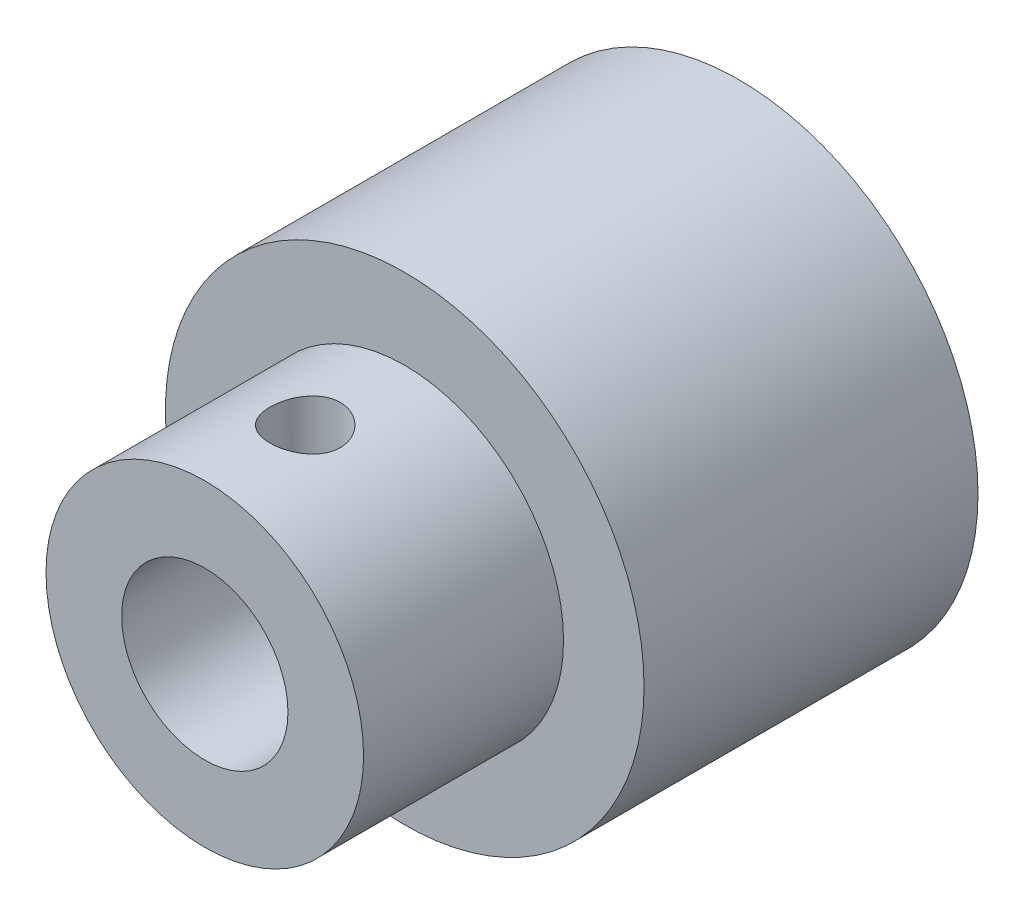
ISO-10303-21;
HEADER;
FILE_DESCRIPTION(('STEP AP214'),'2;1');
FILE_NAME('part.step','',(''),(''),'','','');
FILE_SCHEMA(('AUTOMOTIVE_DESIGN { 1 0 10303 214 1 1 1 1 }'));
ENDSEC;
DATA;
#1=APPLICATION_CONTEXT('core data for automotive mechanical design processes');
#2=APPLICATION_PROTOCOL_DEFINITION('international standard','automotive_design',2000,#1);
#3=PRODUCT_CONTEXT('',#1,'mechanical');
#4=PRODUCT('Part','Part','',(#3));
#5=PRODUCT_RELATED_PRODUCT_CATEGORY('part','',(#4));
#6=PRODUCT_DEFINITION_FORMATION('','',#4);
#7=PRODUCT_DEFINITION_CONTEXT('part definition',#1,'design');
#8=PRODUCT_DEFINITION('design','',#6,#7);
#9=PRODUCT_DEFINITION_SHAPE('','',#8);
#10=(LENGTH_UNIT() NAMED_UNIT(*) SI_UNIT(.MILLI.,.METRE.));
#11=(NAMED_UNIT(*) PLANE_ANGLE_UNIT() SI_UNIT($,.RADIAN.));
#12=(NAMED_UNIT(*) SI_UNIT($,.STERADIAN.) SOLID_ANGLE_UNIT());
#13=UNCERTAINTY_MEASURE_WITH_UNIT(LENGTH_MEASURE(1.E-05),#10,'distance_accuracy_value','');
#14=(GEOMETRIC_REPRESENTATION_CONTEXT(3) GLOBAL_UNCERTAINTY_ASSIGNED_CONTEXT((#13)) GLOBAL_UNIT_ASSIGNED_CONTEXT((#10,
#11,#12)) REPRESENTATION_CONTEXT('',''));
#15=CARTESIAN_POINT('',(0.,0.,0.));
#16=DIRECTION('',(0.,0.,1.));
#17=DIRECTION('',(1.,0.,0.));
#18=AXIS2_PLACEMENT_3D('',#15,#16,#17);
#19=CARTESIAN_POINT('',(0.,0.,0.));
#20=DIRECTION('',(0.,0.,1.));
#21=DIRECTION('',(1.,0.,0.));
#22=AXIS2_PLACEMENT_3D('',#19,#20,#21);
#23=PLANE('',#22);
#24=CARTESIAN_POINT('',(0.,0.,0.));
#25=DIRECTION('',(0.,0.,1.));
#26=DIRECTION('',(1.,0.,0.));
#27=AXIS2_PLACEMENT_3D('',#24,#25,#26);
#28=CIRCLE('',#27,14.2875);
#29=CARTESIAN_POINT('',(14.2875,0.,0.));
#30=VERTEX_POINT('',#29);
#31=EDGE_CURVE('E42',#30,#30,#28,.T.);
#32=ORIENTED_EDGE('',*,*,#31,.T.);
#33=EDGE_LOOP('',(#32));
#34=FACE_BOUND('',#33,.T.);
#35=CARTESIAN_POINT('',(0.,0.,0.));
#36=DIRECTION('',(0.,0.,1.));
#37=DIRECTION('',(1.,0.,0.));
#38=AXIS2_PLACEMENT_3D('',#35,#36,#37);
#39=CIRCLE('',#38,9.48055);
#40=CARTESIAN_POINT('',(9.48055,0.,0.));
#41=VERTEX_POINT('',#40);
#42=EDGE_CURVE('E51',#41,#41,#39,.T.);
#43=ORIENTED_EDGE('',*,*,#42,.F.);
#44=EDGE_LOOP('',(#43));
#45=FACE_BOUND('',#44,.T.);
#46=ADVANCED_FACE('F38',(#34,#45),#23,.T.);
#47=CARTESIAN_POINT('',(0.,0.,-19.939));
#48=DIRECTION('',(0.,0.,1.));
#49=DIRECTION('',(1.,0.,0.));
#50=AXIS2_PLACEMENT_3D('',#47,#48,#49);
#51=CYLINDRICAL_SURFACE('',#50,14.2875);
#52=CARTESIAN_POINT('',(0.,0.,-19.939));
#53=DIRECTION('',(0.,0.,1.));
#54=DIRECTION('',(1.,0.,0.));
#55=AXIS2_PLACEMENT_3D('',#52,#53,#54);
#56=CIRCLE('',#55,14.2875);
#57=CARTESIAN_POINT('',(14.2875,0.,-19.939));
#58=VERTEX_POINT('',#57);
#59=EDGE_CURVE('E10',#58,#58,#56,.T.);
#60=ORIENTED_EDGE('',*,*,#59,.T.);
#61=EDGE_LOOP('',(#60));
#62=FACE_BOUND('',#61,.T.);
#63=ORIENTED_EDGE('',*,*,#31,.F.);
#64=EDGE_LOOP('',(#63));
#65=FACE_BOUND('',#64,.T.);
#66=ADVANCED_FACE('F40',(#62,#65),#51,.T.);
#67=CARTESIAN_POINT('',(0.,0.,-19.939));
#68=DIRECTION('',(0.,0.,1.));
#69=DIRECTION('',(1.,0.,0.));
#70=AXIS2_PLACEMENT_3D('',#67,#68,#69);
#71=PLANE('',#70);
#72=CARTESIAN_POINT('',(0.,0.,-19.939));
#73=DIRECTION('',(0.,0.,1.));
#74=DIRECTION('',(1.,0.,0.));
#75=AXIS2_PLACEMENT_3D('',#72,#73,#74);
#76=CIRCLE('',#75,4.96569999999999);
#77=CARTESIAN_POINT('',(4.96569999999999,0.,-19.939));
#78=VERTEX_POINT('',#77);
#79=EDGE_CURVE('E54',#78,#78,#76,.T.);
#80=ORIENTED_EDGE('',*,*,#79,.T.);
#81=EDGE_LOOP('',(#80));
#82=FACE_BOUND('',#81,.T.);
#83=ORIENTED_EDGE('',*,*,#59,.F.);
#84=EDGE_LOOP('',(#83));
#85=FACE_BOUND('',#84,.T.);
#86=ADVANCED_FACE('F95',(#82,#85),#71,.F.);
#87=CARTESIAN_POINT('',(0.,0.,11.938));
#88=DIRECTION('',(0.,0.,-1.));
#89=DIRECTION('',(-1.,0.,0.));
#90=AXIS2_PLACEMENT_3D('',#87,#88,#89);
#91=CYLINDRICAL_SURFACE('',#90,9.48055);
#92=CARTESIAN_POINT('',(0.,9.48055,8.04360000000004));
#93=CARTESIAN_POINT('',(-0.116434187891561,9.48054785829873,8.04359607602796));
#94=CARTESIAN_POINT('',(-0.232915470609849,9.47838328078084,8.03388380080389));
#95=CARTESIAN_POINT('',(-0.462566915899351,9.46995747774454,7.99533313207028));
#96=CARTESIAN_POINT('',(-0.575734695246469,9.46369337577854,7.96648130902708));
#97=CARTESIAN_POINT('',(-0.795407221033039,9.44776566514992,7.89060154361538));
#98=CARTESIAN_POINT('',(-0.901918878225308,9.43810565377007,7.84359282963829));
#99=CARTESIAN_POINT('',(-1.10553997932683,9.41642754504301,7.73279528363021));
#100=CARTESIAN_POINT('',(-1.20264961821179,9.40440949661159,7.66900679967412));
#101=CARTESIAN_POINT('',(-1.38630919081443,9.37911007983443,7.52535137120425));
#102=CARTESIAN_POINT('',(-1.47268252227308,9.36581271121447,7.44526144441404));
#103=CARTESIAN_POINT('',(-1.63088604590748,9.33956553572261,7.27175518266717));
#104=CARTESIAN_POINT('',(-1.70271491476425,9.32661576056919,7.17833763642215));
#105=CARTESIAN_POINT('',(-1.83057402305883,9.30237195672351,6.97951667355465));
#106=CARTESIAN_POINT('',(-1.88641545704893,9.29109841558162,6.87398911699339));
#107=CARTESIAN_POINT('',(-1.97950321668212,9.27171349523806,6.65475674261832));
#108=CARTESIAN_POINT('',(-2.01675182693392,9.2636017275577,6.54105293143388));
#109=CARTESIAN_POINT('',(-2.07101134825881,9.25162188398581,6.31061368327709));
#110=CARTESIAN_POINT('',(-2.08833535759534,9.24768823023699,6.1939554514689));
#111=CARTESIAN_POINT('',(-2.10322760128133,9.24431310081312,5.95932717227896));
#112=CARTESIAN_POINT('',(-2.1007983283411,9.24487105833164,5.84135729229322));
#113=CARTESIAN_POINT('',(-2.07650474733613,9.2503567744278,5.60978799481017));
#114=CARTESIAN_POINT('',(-2.05500492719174,9.25520257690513,5.49614810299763));
#115=CARTESIAN_POINT('',(-1.9937583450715,9.26858832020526,5.27412935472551));
#116=CARTESIAN_POINT('',(-1.95401053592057,9.27712847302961,5.16575080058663));
#117=CARTESIAN_POINT('',(-1.85706363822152,9.29702095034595,4.95631052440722));
#118=CARTESIAN_POINT('',(-1.79972506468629,9.30839561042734,4.8553155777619));
#119=CARTESIAN_POINT('',(-1.66932230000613,9.33266185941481,4.66424627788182));
#120=CARTESIAN_POINT('',(-1.59625591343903,9.34555365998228,4.57417345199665));
#121=CARTESIAN_POINT('',(-1.43454566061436,9.37175270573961,4.40540753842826));
#122=CARTESIAN_POINT('',(-1.34559204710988,9.38506282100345,4.32701139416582));
#123=CARTESIAN_POINT('',(-1.15564865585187,9.4103384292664,4.18620061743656));
#124=CARTESIAN_POINT('',(-1.0546586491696,9.42230389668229,4.12378628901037));
#125=CARTESIAN_POINT('',(-0.843141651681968,9.44358243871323,4.01663455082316));
#126=CARTESIAN_POINT('',(-0.732593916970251,9.45288954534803,3.97193682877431));
#127=CARTESIAN_POINT('',(-0.505304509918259,9.46775845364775,3.9018347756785));
#128=CARTESIAN_POINT('',(-0.388563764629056,9.47332081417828,3.87642756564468));
#129=CARTESIAN_POINT('',(-0.154748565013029,9.47999368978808,3.84606145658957));
#130=CARTESIAN_POINT('',(-0.0377292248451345,9.48119247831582,3.84069703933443));
#131=CARTESIAN_POINT('',(0.195533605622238,9.4792508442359,3.84946855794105));
#132=CARTESIAN_POINT('',(0.311777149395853,9.47611072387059,3.86360313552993));
#133=CARTESIAN_POINT('',(0.538839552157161,9.46589988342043,3.91063529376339));
#134=CARTESIAN_POINT('',(0.64970480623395,9.4588738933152,3.94331946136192));
#135=CARTESIAN_POINT('',(0.864378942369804,9.44167804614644,4.02628556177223));
#136=CARTESIAN_POINT('',(0.96818721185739,9.43150791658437,4.0765690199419));
#137=CARTESIAN_POINT('',(1.16747219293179,9.40893460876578,4.19414626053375));
#138=CARTESIAN_POINT('',(1.26280537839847,9.39650103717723,4.26167734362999));
#139=CARTESIAN_POINT('',(1.44093176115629,9.37084077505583,4.41152118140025));
#140=CARTESIAN_POINT('',(1.52372328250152,9.35761397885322,4.49383590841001));
#141=CARTESIAN_POINT('',(1.67602525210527,9.331552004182,4.67277333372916));
#142=CARTESIAN_POINT('',(1.74525455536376,9.31872898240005,4.76963743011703));
#143=CARTESIAN_POINT('',(1.8664650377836,9.29521188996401,4.97385513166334));
#144=CARTESIAN_POINT('',(1.91844696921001,9.28451772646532,5.08120827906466));
#145=CARTESIAN_POINT('',(2.0033317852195,9.26657292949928,5.30277786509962));
#146=CARTESIAN_POINT('',(2.03634290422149,9.25930280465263,5.41695118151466));
#147=CARTESIAN_POINT('',(2.08266401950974,9.24899520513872,5.64940659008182));
#148=CARTESIAN_POINT('',(2.09597725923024,9.24595703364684,5.76768800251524));
#149=CARTESIAN_POINT('',(2.10238393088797,9.24450203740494,6.00216529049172));
#150=CARTESIAN_POINT('',(2.0959233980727,9.24598326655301,6.11834856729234));
#151=CARTESIAN_POINT('',(2.06396504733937,9.25316918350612,6.34792666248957));
#152=CARTESIAN_POINT('',(2.03846746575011,9.25887381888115,6.46132151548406));
#153=CARTESIAN_POINT('',(1.96937677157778,9.27381346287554,6.68173863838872));
#154=CARTESIAN_POINT('',(1.9258501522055,9.28303548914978,6.78878268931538));
#155=CARTESIAN_POINT('',(1.82199348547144,9.30397560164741,6.99411456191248));
#156=CARTESIAN_POINT('',(1.76166163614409,9.3156939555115,7.09240144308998));
#157=CARTESIAN_POINT('',(1.62443452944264,9.34060973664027,7.27962418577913));
#158=CARTESIAN_POINT('',(1.54722208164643,9.35383277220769,7.36832419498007));
#159=CARTESIAN_POINT('',(1.37906634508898,9.38009765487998,7.53165459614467));
#160=CARTESIAN_POINT('',(1.28811988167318,9.39313945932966,7.60628172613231));
#161=CARTESIAN_POINT('',(1.09361103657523,9.41777950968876,7.74030554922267));
#162=CARTESIAN_POINT('',(0.98989614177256,9.42935610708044,7.79948510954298));
#163=CARTESIAN_POINT('',(0.773755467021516,9.44954339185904,7.89947734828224));
#164=CARTESIAN_POINT('',(0.661336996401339,9.45815653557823,7.94030524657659));
#165=CARTESIAN_POINT('',(0.457358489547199,9.46993133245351,7.99525896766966));
#166=CARTESIAN_POINT('',(0.366892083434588,9.47388844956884,8.01335189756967));
#167=CARTESIAN_POINT('',(0.184293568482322,9.47919857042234,8.03752368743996));
#168=CARTESIAN_POINT('',(0.0921615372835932,9.48055169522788,8.04360310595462));
#169=CARTESIAN_POINT('',(0.,9.48055,8.04360000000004));
#170=B_SPLINE_CURVE_WITH_KNOTS('',3,(#92,#93,#94,#95,#96,#97,#98,#99,#100,#101,#102,#103,#104,
#105,#106,#107,#108,#109,#110,#111,#112,#113,#114,#115,#116,#117,#118,#119,#120,#121,#122,#123,
#124,#125,#126,#127,#128,#129,#130,#131,#132,#133,#134,#135,#136,#137,#138,#139,#140,#141,#142,
#143,#144,#145,#146,#147,#148,#149,#150,#151,#152,#153,#154,#155,#156,#157,#158,#159,#160,#161,
#162,#163,#164,#165,#166,#167,#168,#169),.UNSPECIFIED.,.T.,.F.,(4,2,2,2,2,2,2,2,2,2,2,2,2,2,2,2,
2,2,2,2,2,2,2,2,2,2,2,2,2,2,2,2,2,2,2,2,2,2,4),(0.,0.348965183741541,0.698175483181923,
1.04701697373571,1.39585122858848,1.74982349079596,2.10382794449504,2.46185517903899,
2.81983840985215,3.17211588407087,3.52434890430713,3.86999150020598,4.21565393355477,
4.56413140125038,4.9126575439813,5.26891919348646,5.62518762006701,5.98224968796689,
6.33925845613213,6.68900362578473,7.03872443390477,7.38450097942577,7.73030750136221,
8.08115542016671,8.43205018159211,8.78958879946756,9.14711182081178,9.50257427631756,
9.85797819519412,10.2054248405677,10.5528671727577,10.8990393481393,11.2452486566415,
11.5986289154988,11.9520909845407,12.3102821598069,12.668175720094,12.9444061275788,
13.2206236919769),.UNSPECIFIED.);
#171=CARTESIAN_POINT('',(0.,9.48055,8.04360000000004));
#172=VERTEX_POINT('',#171);
#173=EDGE_CURVE('E62',#172,#172,#170,.T.);
#174=ORIENTED_EDGE('',*,*,#173,.T.);
#175=EDGE_LOOP('',(#174));
#176=FACE_BOUND('',#175,.T.);
#177=CARTESIAN_POINT('',(0.,0.,11.938));
#178=DIRECTION('',(0.,0.,1.));
#179=DIRECTION('',(1.,0.,0.));
#180=AXIS2_PLACEMENT_3D('',#177,#178,#179);
#181=CIRCLE('',#180,9.48055);
#182=CARTESIAN_POINT('',(9.48055,0.,11.938));
#183=VERTEX_POINT('',#182);
#184=EDGE_CURVE('E49',#183,#183,#181,.T.);
#185=ORIENTED_EDGE('',*,*,#184,.F.);
#186=EDGE_LOOP('',(#185));
#187=FACE_BOUND('',#186,.T.);
#188=ORIENTED_EDGE('',*,*,#42,.T.);
#189=EDGE_LOOP('',(#188));
#190=FACE_BOUND('',#189,.T.);
#191=ADVANCED_FACE('F75',(#176,#187,#190),#91,.T.);
#192=CARTESIAN_POINT('',(0.,0.,11.938));
#193=DIRECTION('',(0.,0.,1.));
#194=DIRECTION('',(1.,0.,0.));
#195=AXIS2_PLACEMENT_3D('',#192,#193,#194);
#196=PLANE('',#195);
#197=CARTESIAN_POINT('',(0.,0.,11.938));
#198=DIRECTION('',(0.,0.,1.));
#199=DIRECTION('',(1.,0.,0.));
#200=AXIS2_PLACEMENT_3D('',#197,#198,#199);
#201=CIRCLE('',#200,4.9657);
#202=CARTESIAN_POINT('',(4.9657,0.,11.938));
#203=VERTEX_POINT('',#202);
#204=EDGE_CURVE('E59',#203,#203,#201,.T.);
#205=ORIENTED_EDGE('',*,*,#204,.F.);
#206=EDGE_LOOP('',(#205));
#207=FACE_BOUND('',#206,.T.);
#208=ORIENTED_EDGE('',*,*,#184,.T.);
#209=EDGE_LOOP('',(#208));
#210=FACE_BOUND('',#209,.T.);
#211=ADVANCED_FACE('F88',(#207,#210),#196,.T.);
#212=CARTESIAN_POINT('',(0.,0.,11.938));
#213=DIRECTION('',(0.,0.,1.));
#214=DIRECTION('',(1.,0.,0.));
#215=AXIS2_PLACEMENT_3D('',#212,#213,#214);
#216=CYLINDRICAL_SURFACE('',#215,4.96569999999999);
#217=CARTESIAN_POINT('',(0.,4.96569999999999,8.04360000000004));
#218=CARTESIAN_POINT('',(0.112333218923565,4.96569660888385,8.04359573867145));
#219=CARTESIAN_POINT('',(0.224856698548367,4.96184510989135,8.03453364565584));
#220=CARTESIAN_POINT('',(0.446696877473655,4.94682392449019,7.99863017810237));
#221=CARTESIAN_POINT('',(0.556004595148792,4.93563546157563,7.97174318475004));
#222=CARTESIAN_POINT('',(0.767852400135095,4.90713390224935,7.90135732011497));
#223=CARTESIAN_POINT('',(0.870414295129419,4.88984182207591,7.85791541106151));
#224=CARTESIAN_POINT('',(1.06669208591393,4.85081138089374,7.75589415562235));
#225=CARTESIAN_POINT('',(1.16041050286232,4.82907429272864,7.69731914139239));
#226=CARTESIAN_POINT('',(1.34131089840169,4.78207104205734,7.56351638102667));
#227=CARTESIAN_POINT('',(1.42797896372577,4.75668706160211,7.48763558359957));
#228=CARTESIAN_POINT('',(1.58780343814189,4.70575250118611,7.32275727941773));
#229=CARTESIAN_POINT('',(1.66095253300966,4.68020183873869,7.23375271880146));
#230=CARTESIAN_POINT('',(1.79535614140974,4.63036473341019,7.0396501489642));
#231=CARTESIAN_POINT('',(1.85581298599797,4.60620937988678,6.9339625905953));
#232=CARTESIAN_POINT('',(1.95786161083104,4.56377382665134,6.71275043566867));
#233=CARTESIAN_POINT('',(1.99946339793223,4.54549051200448,6.59723109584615));
#234=CARTESIAN_POINT('',(2.06048249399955,4.51814820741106,6.36555076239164));
#235=CARTESIAN_POINT('',(2.08089053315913,4.50867965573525,6.24970094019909));
#236=CARTESIAN_POINT('',(2.1020318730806,4.4988652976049,6.01586417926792));
#237=CARTESIAN_POINT('',(2.10277649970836,4.49851423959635,5.89787850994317));
#238=CARTESIAN_POINT('',(2.08531442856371,4.50662898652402,5.6731277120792));
#239=CARTESIAN_POINT('',(2.06860821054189,4.51439674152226,5.5662156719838));
#240=CARTESIAN_POINT('',(2.01924127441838,4.53669118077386,5.35688547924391));
#241=CARTESIAN_POINT('',(1.98657739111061,4.55121920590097,5.25446822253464));
#242=CARTESIAN_POINT('',(1.90558158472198,4.58572803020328,5.05440858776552));
#243=CARTESIAN_POINT('',(1.85692683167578,4.60581970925,4.95691689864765));
#244=CARTESIAN_POINT('',(1.74555940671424,4.64916807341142,4.77109508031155));
#245=CARTESIAN_POINT('',(1.68284109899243,4.67242602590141,4.68276864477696));
#246=CARTESIAN_POINT('',(1.53870147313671,4.72195570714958,4.50966762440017));
#247=CARTESIAN_POINT('',(1.4561253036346,4.74831327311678,4.42587645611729));
#248=CARTESIAN_POINT('',(1.27783998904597,4.7993639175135,4.27299580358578));
#249=CARTESIAN_POINT('',(1.182127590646,4.82405658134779,4.20390997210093));
#250=CARTESIAN_POINT('',(0.977221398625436,4.86975193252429,4.08089918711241));
#251=CARTESIAN_POINT('',(0.867755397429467,4.89064974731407,4.02738580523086));
#252=CARTESIAN_POINT('',(0.640264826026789,4.92559092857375,3.93988115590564));
#253=CARTESIAN_POINT('',(0.52224517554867,4.9396381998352,3.90587876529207));
#254=CARTESIAN_POINT('',(0.289205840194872,4.95855928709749,3.86044634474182));
#255=CARTESIAN_POINT('',(0.174486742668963,4.96396820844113,3.84769726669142));
#256=CARTESIAN_POINT('',(-0.0555703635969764,4.9667198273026,3.8411865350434));
#257=CARTESIAN_POINT('',(-0.170908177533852,4.96406493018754,3.84741921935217));
#258=CARTESIAN_POINT('',(-0.39267510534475,4.9513327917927,3.87776112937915));
#259=CARTESIAN_POINT('',(-0.499257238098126,4.94164451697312,3.90093396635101));
#260=CARTESIAN_POINT('',(-0.706898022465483,4.91624042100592,3.96318394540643));
#261=CARTESIAN_POINT('',(-0.807955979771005,4.90052384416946,4.00226308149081));
#262=CARTESIAN_POINT('',(-1.00523963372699,4.8639545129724,4.09648958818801));
#263=CARTESIAN_POINT('',(-1.10121653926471,4.8429569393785,4.1520998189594));
#264=CARTESIAN_POINT('',(-1.28282137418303,4.79805282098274,4.27730272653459));
#265=CARTESIAN_POINT('',(-1.36844490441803,4.77414504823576,4.34690131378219));
#266=CARTESIAN_POINT('',(-1.53353310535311,4.72381617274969,4.5040858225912));
#267=CARTESIAN_POINT('',(-1.61208227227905,4.6973395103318,4.59261793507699));
#268=CARTESIAN_POINT('',(-1.75347593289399,4.64641369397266,4.78201008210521));
#269=CARTESIAN_POINT('',(-1.81631645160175,4.62196505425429,4.88287322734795));
#270=CARTESIAN_POINT('',(-1.92530485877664,4.57765327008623,5.09637674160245));
#271=CARTESIAN_POINT('',(-1.97116705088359,4.55787047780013,5.20918087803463));
#272=CARTESIAN_POINT('',(-2.04284455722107,4.52620441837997,5.44201311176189));
#273=CARTESIAN_POINT('',(-2.06867707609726,4.51431437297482,5.56203491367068));
#274=CARTESIAN_POINT('',(-2.09782805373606,4.50083638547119,5.79570571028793));
#275=CARTESIAN_POINT('',(-2.10276018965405,4.49851047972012,5.90911163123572));
#276=CARTESIAN_POINT('',(-2.09430491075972,4.50245338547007,6.13507417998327));
#277=CARTESIAN_POINT('',(-2.08092051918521,4.5087207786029,6.24763094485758));
#278=CARTESIAN_POINT('',(-2.037581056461,4.52846098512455,6.46296096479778));
#279=CARTESIAN_POINT('',(-2.00847709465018,4.54156261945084,6.56594285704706));
#280=CARTESIAN_POINT('',(-1.93537086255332,4.57319295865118,6.76557819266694));
#281=CARTESIAN_POINT('',(-1.89136438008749,4.59172319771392,6.8622298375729));
#282=CARTESIAN_POINT('',(-1.78660917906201,4.6335261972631,7.05291305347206));
#283=CARTESIAN_POINT('',(-1.72500161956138,4.65701958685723,7.14642349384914));
#284=CARTESIAN_POINT('',(-1.58797612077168,4.70550595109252,7.32228352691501));
#285=CARTESIAN_POINT('',(-1.51255316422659,4.73049946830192,7.4046290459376));
#286=CARTESIAN_POINT('',(-1.3432410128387,4.78145015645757,7.56226419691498));
#287=CARTESIAN_POINT('',(-1.24838418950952,4.80733626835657,7.63654240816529));
#288=CARTESIAN_POINT('',(-1.04660136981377,4.85525899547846,7.76819099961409));
#289=CARTESIAN_POINT('',(-0.939669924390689,4.87729386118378,7.82555370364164));
#290=CARTESIAN_POINT('',(-0.718302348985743,4.9147353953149,7.92054916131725));
#291=CARTESIAN_POINT('',(-0.604008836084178,4.93023983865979,7.95847494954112));
#292=CARTESIAN_POINT('',(-0.370057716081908,4.95327678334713,8.01421091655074));
#293=CARTESIAN_POINT('',(-0.25041803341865,4.96083410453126,8.03208373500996));
#294=CARTESIAN_POINT('',(-0.108569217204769,4.96456113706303,8.0409051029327));
#295=CARTESIAN_POINT('',(-0.0868717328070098,4.96498756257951,8.04191485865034));
#296=CARTESIAN_POINT('',(-0.0434518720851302,4.96555732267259,8.04326272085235));
#297=CARTESIAN_POINT('',(-0.0217294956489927,4.96570065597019,8.04360082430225));
#298=CARTESIAN_POINT('',(0.,4.96569999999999,8.04360000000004));
#299=B_SPLINE_CURVE_WITH_KNOTS('',3,(#217,#218,#219,#220,#221,#222,#223,#224,#225,#226,#227,
#228,#229,#230,#231,#232,#233,#234,#235,#236,#237,#238,#239,#240,#241,#242,#243,#244,#245,#246,
#247,#248,#249,#250,#251,#252,#253,#254,#255,#256,#257,#258,#259,#260,#261,#262,#263,#264,#265,
#266,#267,#268,#269,#270,#271,#272,#273,#274,#275,#276,#277,#278,#279,#280,#281,#282,#283,#284,
#285,#286,#287,#288,#289,#290,#291,#292,#293,#294,#295,#296,#297,#298),.UNSPECIFIED.,.T.,.F.,(4,
2,2,2,2,2,2,2,2,2,2,2,2,2,2,2,2,2,2,2,2,2,2,2,2,2,2,2,2,2,2,2,2,2,2,2,2,2,2,2,4),(0.,
0.336909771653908,0.674685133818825,1.01130862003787,1.34783584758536,1.70017276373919,
2.05269975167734,2.42321990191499,2.79354317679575,3.14564743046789,3.49754887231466,
3.82150113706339,4.14551768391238,4.47652480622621,4.8076648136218,5.16771646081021,
5.5278574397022,5.89679587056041,6.26552376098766,6.61037560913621,6.9551246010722,
7.28213361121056,7.60918362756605,7.94642734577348,8.28381385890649,8.6460031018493,
9.00828390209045,9.37641012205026,9.74421978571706,10.0830465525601,10.4218174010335,
10.7438557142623,11.0659851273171,11.4078016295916,11.749742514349,12.1176629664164,
12.4857501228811,12.848111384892,13.209337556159,13.2745083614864,13.3396794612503),.UNSPECIFIED.);
#300=CARTESIAN_POINT('',(0.,4.96569999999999,8.04360000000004));
#301=VERTEX_POINT('',#300);
#302=EDGE_CURVE('E70',#301,#301,#299,.T.);
#303=ORIENTED_EDGE('',*,*,#302,.T.);
#304=EDGE_LOOP('',(#303));
#305=FACE_BOUND('',#304,.T.);
#306=ORIENTED_EDGE('',*,*,#79,.F.);
#307=EDGE_LOOP('',(#306));
#308=FACE_BOUND('',#307,.T.);
#309=ORIENTED_EDGE('',*,*,#204,.T.);
#310=EDGE_LOOP('',(#309));
#311=FACE_BOUND('',#310,.T.);
#312=ADVANCED_FACE('F82',(#305,#308,#311),#216,.F.);
#313=CARTESIAN_POINT('',(0.,9.48055,5.94360000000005));
#314=DIRECTION('',(0.,1.,0.));
#315=DIRECTION('',(0.,0.,1.));
#316=AXIS2_PLACEMENT_3D('',#313,#314,#315);
#317=CYLINDRICAL_SURFACE('',#316,2.09999999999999);
#318=ORIENTED_EDGE('',*,*,#302,.F.);
#319=EDGE_LOOP('',(#318));
#320=FACE_BOUND('',#319,.T.);
#321=ORIENTED_EDGE('',*,*,#173,.F.);
#322=EDGE_LOOP('',(#321));
#323=FACE_BOUND('',#322,.T.);
#324=ADVANCED_FACE('F79',(#320,#323),#317,.F.);
#325=CLOSED_SHELL('',(#46,#66,#86,#191,#211,#312,#324));
#326=MANIFOLD_SOLID_BREP('B2',#325);
#327=ADVANCED_BREP_SHAPE_REPRESENTATION('',(#18,#326),#14);
#328=SHAPE_DEFINITION_REPRESENTATION(#9,#327);
ENDSEC;
END-ISO-10303-21;
